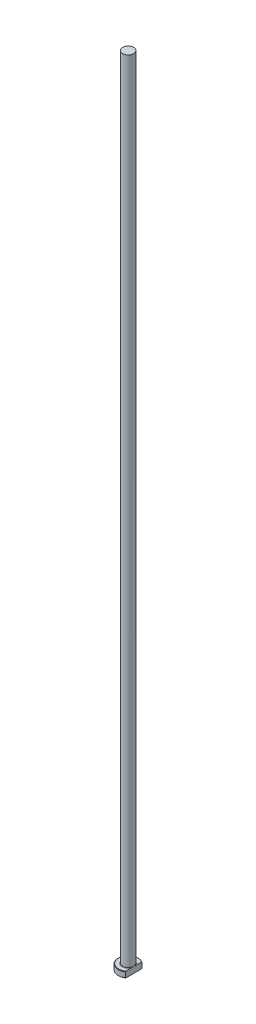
ISO-10303-21;
HEADER;
FILE_DESCRIPTION(('STEP AP214'),'2;1');
FILE_NAME('part.step','',(''),(''),'','','');
FILE_SCHEMA(('AUTOMOTIVE_DESIGN { 1 0 10303 214 1 1 1 1 }'));
ENDSEC;
DATA;
#1=APPLICATION_CONTEXT('core data for automotive mechanical design processes');
#2=APPLICATION_PROTOCOL_DEFINITION('international standard','automotive_design',2000,#1);
#3=PRODUCT_CONTEXT('',#1,'mechanical');
#4=PRODUCT('Part','Part','',(#3));
#5=PRODUCT_RELATED_PRODUCT_CATEGORY('part','',(#4));
#6=PRODUCT_DEFINITION_FORMATION('','',#4);
#7=PRODUCT_DEFINITION_CONTEXT('part definition',#1,'design');
#8=PRODUCT_DEFINITION('design','',#6,#7);
#9=PRODUCT_DEFINITION_SHAPE('','',#8);
#10=(LENGTH_UNIT() NAMED_UNIT(*) SI_UNIT(.MILLI.,.METRE.));
#11=(NAMED_UNIT(*) PLANE_ANGLE_UNIT() SI_UNIT($,.RADIAN.));
#12=(NAMED_UNIT(*) SI_UNIT($,.STERADIAN.) SOLID_ANGLE_UNIT());
#13=UNCERTAINTY_MEASURE_WITH_UNIT(LENGTH_MEASURE(1.E-05),#10,'distance_accuracy_value','');
#14=(GEOMETRIC_REPRESENTATION_CONTEXT(3) GLOBAL_UNCERTAINTY_ASSIGNED_CONTEXT((#13)) GLOBAL_UNIT_ASSIGNED_CONTEXT((#10,
#11,#12)) REPRESENTATION_CONTEXT('',''));
#15=CARTESIAN_POINT('',(0.,0.,0.));
#16=DIRECTION('',(0.,0.,1.));
#17=DIRECTION('',(1.,0.,0.));
#18=AXIS2_PLACEMENT_3D('',#15,#16,#17);
#19=CARTESIAN_POINT('',(0.,0.,0.));
#20=DIRECTION('',(0.,-1.,0.));
#21=DIRECTION('',(0.,0.,-1.));
#22=AXIS2_PLACEMENT_3D('',#19,#20,#21);
#23=PLANE('',#22);
#24=CARTESIAN_POINT('',(0.,0.,0.));
#25=DIRECTION('',(0.,-1.,0.));
#26=DIRECTION('',(0.,0.,-1.));
#27=AXIS2_PLACEMENT_3D('',#24,#25,#26);
#28=CIRCLE('',#27,4.79999999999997);
#29=CARTESIAN_POINT('',(2.74999999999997,0.,3.93414539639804));
#30=VERTEX_POINT('',#29);
#31=CARTESIAN_POINT('',(2.74999999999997,0.,-3.93414539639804));
#32=VERTEX_POINT('',#31);
#33=EDGE_CURVE('E98',#30,#32,#28,.T.);
#34=ORIENTED_EDGE('',*,*,#33,.T.);
#35=DIRECTION('',(0.,0.,1.));
#36=VECTOR('',#35,1.);
#37=CARTESIAN_POINT('',(2.74999999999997,0.,-4.1758232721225));
#38=LINE('',#37,#36);
#39=EDGE_CURVE('E83',#32,#30,#38,.T.);
#40=ORIENTED_EDGE('',*,*,#39,.T.);
#41=EDGE_LOOP('',(#34,#40));
#42=FACE_BOUND('',#41,.T.);
#43=ADVANCED_FACE('F32',(#42),#23,.T.);
#44=CARTESIAN_POINT('',(0.,259.958771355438,0.));
#45=DIRECTION('',(0.,1.,0.));
#46=DIRECTION('',(0.,0.,1.));
#47=AXIS2_PLACEMENT_3D('',#44,#45,#46);
#48=CYLINDRICAL_SURFACE('',#47,4.99999999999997);
#49=CARTESIAN_POINT('',(0.,2.80000000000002,0.));
#50=DIRECTION('',(0.,1.,0.));
#51=DIRECTION('',(0.,0.,1.));
#52=AXIS2_PLACEMENT_3D('',#49,#50,#51);
#53=CIRCLE('',#52,4.99999999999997);
#54=CARTESIAN_POINT('',(2.74999999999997,2.80000000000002,4.1758232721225));
#55=VERTEX_POINT('',#54);
#56=CARTESIAN_POINT('',(2.74999999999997,2.80000000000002,-4.1758232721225));
#57=VERTEX_POINT('',#56);
#58=EDGE_CURVE('E104',#55,#57,#53,.F.);
#59=ORIENTED_EDGE('',*,*,#58,.T.);
#60=DIRECTION('',(0.,-1.,0.));
#61=VECTOR('',#60,1.);
#62=CARTESIAN_POINT('',(2.74999999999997,400.,-4.1758232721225));
#63=LINE('',#62,#61);
#64=CARTESIAN_POINT('',(2.74999999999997,0.199999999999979,-4.1758232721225));
#65=VERTEX_POINT('',#64);
#66=EDGE_CURVE('E183',#57,#65,#63,.T.);
#67=ORIENTED_EDGE('',*,*,#66,.T.);
#68=CARTESIAN_POINT('',(0.,0.199999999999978,0.));
#69=DIRECTION('',(0.,-1.,0.));
#70=DIRECTION('',(0.,0.,-1.));
#71=AXIS2_PLACEMENT_3D('',#68,#69,#70);
#72=CIRCLE('',#71,4.99999999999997);
#73=CARTESIAN_POINT('',(2.74999999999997,0.199999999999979,4.1758232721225));
#74=VERTEX_POINT('',#73);
#75=EDGE_CURVE('E100',#65,#74,#72,.F.);
#76=ORIENTED_EDGE('',*,*,#75,.T.);
#77=DIRECTION('',(0.,-1.,0.));
#78=VECTOR('',#77,1.);
#79=CARTESIAN_POINT('',(2.74999999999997,400.,4.1758232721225));
#80=LINE('',#79,#78);
#81=EDGE_CURVE('E93',#55,#74,#80,.T.);
#82=ORIENTED_EDGE('',*,*,#81,.F.);
#83=EDGE_LOOP('',(#59,#67,#76,#82));
#84=FACE_BOUND('',#83,.T.);
#85=ADVANCED_FACE('F158',(#84),#48,.T.);
#86=CARTESIAN_POINT('',(-4.99999999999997,3.,0.));
#87=DIRECTION('',(0.,1.,0.));
#88=DIRECTION('',(0.,0.,1.));
#89=AXIS2_PLACEMENT_3D('',#86,#87,#88);
#90=PLANE('',#89);
#91=CARTESIAN_POINT('',(0.,3.,0.));
#92=DIRECTION('',(0.,1.,0.));
#93=DIRECTION('',(0.,0.,1.));
#94=AXIS2_PLACEMENT_3D('',#91,#92,#93);
#95=CIRCLE('',#94,4.79999999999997);
#96=CARTESIAN_POINT('',(2.74999999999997,3.,-3.93414539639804));
#97=VERTEX_POINT('',#96);
#98=CARTESIAN_POINT('',(2.74999999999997,3.,3.93414539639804));
#99=VERTEX_POINT('',#98);
#100=EDGE_CURVE('E178',#97,#99,#95,.T.);
#101=ORIENTED_EDGE('',*,*,#100,.T.);
#102=DIRECTION('',(0.,0.,-1.));
#103=VECTOR('',#102,1.);
#104=CARTESIAN_POINT('',(2.74999999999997,3.,0.));
#105=LINE('',#104,#103);
#106=CARTESIAN_POINT('',(2.74999999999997,2.99999999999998,1.06770782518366));
#107=VERTEX_POINT('',#106);
#108=EDGE_CURVE('E57',#99,#107,#105,.T.);
#109=ORIENTED_EDGE('',*,*,#108,.T.);
#110=CARTESIAN_POINT('',(0.,3.,0.));
#111=DIRECTION('',(0.,1.,0.));
#112=DIRECTION('',(0.,0.,1.));
#113=AXIS2_PLACEMENT_3D('',#110,#111,#112);
#114=CIRCLE('',#113,2.94999999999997);
#115=CARTESIAN_POINT('',(2.74999999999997,2.99999999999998,-1.06770782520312));
#116=VERTEX_POINT('',#115);
#117=EDGE_CURVE('E107',#107,#116,#114,.F.);
#118=ORIENTED_EDGE('',*,*,#117,.T.);
#119=EDGE_CURVE('E136',#116,#97,#105,.T.);
#120=ORIENTED_EDGE('',*,*,#119,.T.);
#121=EDGE_LOOP('',(#101,#109,#118,#120));
#122=FACE_BOUND('',#121,.T.);
#123=ADVANCED_FACE('F147',(#122),#90,.T.);
#124=CARTESIAN_POINT('',(0.,3.,0.));
#125=DIRECTION('',(0.,-1.,0.));
#126=DIRECTION('',(0.,0.,-1.));
#127=AXIS2_PLACEMENT_3D('',#124,#125,#126);
#128=CONICAL_SURFACE('',#127,4.79999999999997,0.785398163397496);
#129=ORIENTED_EDGE('',*,*,#58,.F.);
#130=CARTESIAN_POINT('',(2.74999999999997,-1.79114558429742,9.18844783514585));
#131=CARTESIAN_POINT('',(2.74999999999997,-1.62476324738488,9.0147689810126));
#132=CARTESIAN_POINT('',(2.74999999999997,-1.45857819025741,8.84090089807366));
#133=CARTESIAN_POINT('',(2.74999999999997,-1.12668775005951,8.49270511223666));
#134=CARTESIAN_POINT('',(2.74999999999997,-0.960982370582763,8.31837740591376));
#135=CARTESIAN_POINT('',(2.74999999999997,-0.464632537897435,7.79449769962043));
#136=CARTESIAN_POINT('',(2.74999999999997,-0.13483958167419,7.44413786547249));
#137=CARTESIAN_POINT('',(2.74999999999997,0.521406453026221,6.74030951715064));
#138=CARTESIAN_POINT('',(2.74999999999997,0.847859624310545,6.38684108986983));
#139=CARTESIAN_POINT('',(2.74999999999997,1.33353933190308,5.85303151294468));
#140=CARTESIAN_POINT('',(2.74999999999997,1.49475728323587,5.67450358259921));
#141=CARTESIAN_POINT('',(2.74999999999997,1.8154555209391,5.31589537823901));
#142=CARTESIAN_POINT('',(2.74999999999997,1.97493583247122,5.13581512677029));
#143=CARTESIAN_POINT('',(2.74999999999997,2.28246157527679,4.78409714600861));
#144=CARTESIAN_POINT('',(2.74999999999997,2.43063567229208,4.6125721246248));
#145=CARTESIAN_POINT('',(2.74999999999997,2.72427023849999,4.26717959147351));
#146=CARTESIAN_POINT('',(2.74999999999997,2.86973045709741,4.09331186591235));
#147=CARTESIAN_POINT('',(2.74999999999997,3.15716227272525,3.74214491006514));
#148=CARTESIAN_POINT('',(2.74999999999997,3.29912659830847,3.56483970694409));
#149=CARTESIAN_POINT('',(2.74999999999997,3.57763983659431,3.20603939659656));
#150=CARTESIAN_POINT('',(2.74999999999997,3.7141898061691,3.02454511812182));
#151=CARTESIAN_POINT('',(2.74999999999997,3.93857405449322,2.71219163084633));
#152=CARTESIAN_POINT('',(2.74999999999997,4.02851673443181,2.58285434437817));
#153=CARTESIAN_POINT('',(2.74999999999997,4.20308451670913,2.3205424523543));
#154=CARTESIAN_POINT('',(2.74999999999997,4.28770764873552,2.18756652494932));
#155=CARTESIAN_POINT('',(2.74999999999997,4.44931959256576,1.91735675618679));
#156=CARTESIAN_POINT('',(2.74999999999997,4.52632375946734,1.7801322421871));
#157=CARTESIAN_POINT('',(2.74999999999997,4.66966790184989,1.50031327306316));
#158=CARTESIAN_POINT('',(2.74999999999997,4.73601725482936,1.35772367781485));
#159=CARTESIAN_POINT('',(2.74999999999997,4.86065113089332,1.04856386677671));
#160=CARTESIAN_POINT('',(2.74999999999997,4.91700799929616,0.881171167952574));
#161=CARTESIAN_POINT('',(2.74999999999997,4.9810280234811,0.625229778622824));
#162=CARTESIAN_POINT('',(2.74999999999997,4.99893817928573,0.539229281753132));
#163=CARTESIAN_POINT('',(2.74999999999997,5.02707157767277,0.365959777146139));
#164=CARTESIAN_POINT('',(2.74999999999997,5.03729562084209,0.278690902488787));
#165=CARTESIAN_POINT('',(2.74999999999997,5.04949232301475,0.102763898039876));
#166=CARTESIAN_POINT('',(2.74999999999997,5.05138838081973,0.0141003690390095));
#167=CARTESIAN_POINT('',(2.74999999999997,5.04659669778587,-0.16299024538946));
#168=CARTESIAN_POINT('',(2.74999999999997,5.03990892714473,-0.25141732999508));
#169=CARTESIAN_POINT('',(2.74999999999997,5.01835539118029,-0.427430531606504));
#170=CARTESIAN_POINT('',(2.74999999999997,5.00347341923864,-0.51501463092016));
#171=CARTESIAN_POINT('',(2.74999999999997,4.96636720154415,-0.688602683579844));
#172=CARTESIAN_POINT('',(2.74999999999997,4.94414138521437,-0.774606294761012));
#173=CARTESIAN_POINT('',(2.74999999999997,4.88037969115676,-0.988315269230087));
#174=CARTESIAN_POINT('',(2.74999999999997,4.8347849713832,-1.11480587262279));
#175=CARTESIAN_POINT('',(2.74999999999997,4.73271903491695,-1.36329985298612));
#176=CARTESIAN_POINT('',(2.74999999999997,4.67623944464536,-1.48529968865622));
#177=CARTESIAN_POINT('',(2.74999999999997,4.55498227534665,-1.72582737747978));
#178=CARTESIAN_POINT('',(2.74999999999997,4.49016436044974,-1.84433466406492));
#179=CARTESIAN_POINT('',(2.74999999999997,4.38849038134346,-2.01944141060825));
#180=CARTESIAN_POINT('',(2.74999999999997,4.35386385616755,-2.07735876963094));
#181=CARTESIAN_POINT('',(2.74999999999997,4.28331846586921,-2.19239883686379));
#182=CARTESIAN_POINT('',(2.74999999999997,4.24739965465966,-2.24952157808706));
#183=CARTESIAN_POINT('',(2.74999999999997,4.12488368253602,-2.44019263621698));
#184=CARTESIAN_POINT('',(2.74999999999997,4.03574833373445,-2.57211125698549));
#185=CARTESIAN_POINT('',(2.74999999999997,3.85300432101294,-2.83282496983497));
#186=CARTESIAN_POINT('',(2.74999999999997,3.75939460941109,-2.96161931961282));
#187=CARTESIAN_POINT('',(2.74999999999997,3.56878484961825,-3.21681212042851));
#188=CARTESIAN_POINT('',(2.74999999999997,3.47178237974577,-3.34320875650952));
#189=CARTESIAN_POINT('',(2.74999999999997,3.27524323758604,-3.59402090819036));
#190=CARTESIAN_POINT('',(2.74999999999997,3.17570641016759,-3.71843630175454));
#191=CARTESIAN_POINT('',(2.74999999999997,2.97442282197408,-3.96596722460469));
#192=CARTESIAN_POINT('',(2.74999999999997,2.87267126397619,-4.08907884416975));
#193=CARTESIAN_POINT('',(2.74999999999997,2.66760125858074,-4.3339916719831));
#194=CARTESIAN_POINT('',(2.74999999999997,2.56428277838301,-4.45579285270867));
#195=CARTESIAN_POINT('',(2.74999999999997,2.25255029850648,-4.81947940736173));
#196=CARTESIAN_POINT('',(2.74999999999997,2.04226620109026,-5.05976099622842));
#197=CARTESIAN_POINT('',(2.74999999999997,1.61812846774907,-5.5376054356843));
#198=CARTESIAN_POINT('',(2.74999999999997,1.40427119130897,-5.77516503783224));
#199=CARTESIAN_POINT('',(2.74999999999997,0.974157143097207,-6.24814387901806));
#200=CARTESIAN_POINT('',(2.74999999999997,0.757900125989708,-6.48356289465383));
#201=CARTESIAN_POINT('',(2.74999999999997,0.323911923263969,-6.95249982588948));
#202=CARTESIAN_POINT('',(2.74999999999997,0.106182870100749,-7.186019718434));
#203=CARTESIAN_POINT('',(2.74999999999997,-0.330587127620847,-7.65182952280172));
#204=CARTESIAN_POINT('',(2.74999999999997,-0.549628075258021,-7.88411943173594));
#205=CARTESIAN_POINT('',(2.74999999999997,-0.854135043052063,-8.20563072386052));
#206=CARTESIAN_POINT('',(2.74999999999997,-0.939169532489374,-8.29526139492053));
#207=CARTESIAN_POINT('',(2.74999999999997,-1.10939110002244,-8.47440444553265));
#208=CARTESIAN_POINT('',(2.74999999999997,-1.19457819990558,-8.56391680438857));
#209=CARTESIAN_POINT('',(2.74999999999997,-1.36493542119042,-8.74266965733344));
#210=CARTESIAN_POINT('',(2.74999999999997,-1.45010532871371,-8.83191035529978));
#211=CARTESIAN_POINT('',(2.74999999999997,-1.62054776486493,-9.01026683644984));
#212=CARTESIAN_POINT('',(2.74999999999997,-1.70582027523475,-9.09938263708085));
#213=CARTESIAN_POINT('',(2.74999999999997,-1.79114558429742,-9.18844783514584));
#214=B_SPLINE_CURVE_WITH_KNOTS('',3,(#130,#131,#132,#133,#134,#135,#136,#137,#138,#139,#140,
#141,#142,#143,#144,#145,#146,#147,#148,#149,#150,#151,#152,#153,#154,#155,#156,#157,#158,#159,
#160,#161,#162,#163,#164,#165,#166,#167,#168,#169,#170,#171,#172,#173,#174,#175,#176,#177,#178,
#179,#180,#181,#182,#183,#184,#185,#186,#187,#188,#189,#190,#191,#192,#193,#194,#195,#196,#197,
#198,#199,#200,#201,#202,#203,#204,#205,#206,#207,#208,#209,#210,#211,#212,#213),.UNSPECIFIED.,
.F.,.F.,(4,2,2,2,2,2,2,2,2,2,2,2,2,2,2,2,2,2,2,2,2,2,2,2,2,2,2,2,2,2,2,2,2,2,2,2,2,2,2,2,2,4),
(0.,0.721544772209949,1.4430949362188,2.88656432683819,4.32999349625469,5.05163004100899,
5.77325612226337,6.45322671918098,7.13325979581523,7.81460476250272,8.49581607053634,
8.96833065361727,9.4410192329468,9.91273488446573,10.3840330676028,10.9119743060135,
11.1752192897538,11.4384368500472,11.7040704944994,11.9697050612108,12.2358669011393,
12.5020857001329,12.9047274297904,13.3076801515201,13.712661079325,13.9150857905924,
14.1175020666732,14.5949844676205,15.0725792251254,15.5505221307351,16.0284943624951,
16.5076321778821,16.9867800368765,17.94463622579,18.9035363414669,19.862535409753,
20.8203587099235,21.7781842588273,22.1488332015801,22.5195401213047,22.889621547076,
23.259644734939),.UNSPECIFIED.);
#215=EDGE_CURVE('E135',#55,#99,#214,.T.);
#216=ORIENTED_EDGE('',*,*,#215,.T.);
#217=ORIENTED_EDGE('',*,*,#100,.F.);
#218=EDGE_CURVE('E127',#97,#57,#214,.T.);
#219=ORIENTED_EDGE('',*,*,#218,.T.);
#220=EDGE_LOOP('',(#129,#216,#217,#219));
#221=FACE_BOUND('',#220,.T.);
#222=ADVANCED_FACE('F143',(#221),#128,.T.);
#223=CARTESIAN_POINT('',(0.,0.199999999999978,0.));
#224=DIRECTION('',(0.,1.,0.));
#225=DIRECTION('',(0.,0.,1.));
#226=AXIS2_PLACEMENT_3D('',#223,#224,#225);
#227=CONICAL_SURFACE('',#226,4.99999999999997,0.785398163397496);
#228=ORIENTED_EDGE('',*,*,#75,.F.);
#229=CARTESIAN_POINT('',(2.74999999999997,4.79114558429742,-9.18844783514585));
#230=CARTESIAN_POINT('',(2.74999999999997,4.62476324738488,-9.0147689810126));
#231=CARTESIAN_POINT('',(2.74999999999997,4.45857819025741,-8.84090089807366));
#232=CARTESIAN_POINT('',(2.74999999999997,4.12668775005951,-8.49270511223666));
#233=CARTESIAN_POINT('',(2.74999999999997,3.96098237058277,-8.31837740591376));
#234=CARTESIAN_POINT('',(2.74999999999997,3.46463253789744,-7.79449769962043));
#235=CARTESIAN_POINT('',(2.74999999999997,3.13483958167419,-7.44413786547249));
#236=CARTESIAN_POINT('',(2.74999999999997,2.47859354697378,-6.74030951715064));
#237=CARTESIAN_POINT('',(2.74999999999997,2.15214037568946,-6.38684108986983));
#238=CARTESIAN_POINT('',(2.74999999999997,1.66646066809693,-5.85303151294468));
#239=CARTESIAN_POINT('',(2.74999999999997,1.50524271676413,-5.67450358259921));
#240=CARTESIAN_POINT('',(2.74999999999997,1.1845444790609,-5.31589537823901));
#241=CARTESIAN_POINT('',(2.74999999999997,1.02506416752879,-5.13581512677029));
#242=CARTESIAN_POINT('',(2.74999999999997,0.717538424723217,-4.78409714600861));
#243=CARTESIAN_POINT('',(2.74999999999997,0.569364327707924,-4.6125721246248));
#244=CARTESIAN_POINT('',(2.74999999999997,0.275729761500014,-4.26717959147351));
#245=CARTESIAN_POINT('',(2.74999999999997,0.130269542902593,-4.09331186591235));
#246=CARTESIAN_POINT('',(2.74999999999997,-0.157162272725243,-3.74214491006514));
#247=CARTESIAN_POINT('',(2.74999999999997,-0.299126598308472,-3.56483970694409));
#248=CARTESIAN_POINT('',(2.74999999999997,-0.577639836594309,-3.20603939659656));
#249=CARTESIAN_POINT('',(2.74999999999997,-0.714189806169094,-3.02454511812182));
#250=CARTESIAN_POINT('',(2.74999999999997,-0.938574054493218,-2.71219163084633));
#251=CARTESIAN_POINT('',(2.74999999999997,-1.02851673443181,-2.58285434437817));
#252=CARTESIAN_POINT('',(2.74999999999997,-1.20308451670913,-2.3205424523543));
#253=CARTESIAN_POINT('',(2.74999999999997,-1.28770764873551,-2.18756652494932));
#254=CARTESIAN_POINT('',(2.74999999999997,-1.44931959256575,-1.91735675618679));
#255=CARTESIAN_POINT('',(2.74999999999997,-1.52632375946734,-1.7801322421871));
#256=CARTESIAN_POINT('',(2.74999999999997,-1.66966790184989,-1.50031327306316));
#257=CARTESIAN_POINT('',(2.74999999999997,-1.73601725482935,-1.35772367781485));
#258=CARTESIAN_POINT('',(2.74999999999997,-1.86065113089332,-1.04856386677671));
#259=CARTESIAN_POINT('',(2.74999999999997,-1.91700799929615,-0.881171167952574));
#260=CARTESIAN_POINT('',(2.74999999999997,-1.9810280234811,-0.625229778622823));
#261=CARTESIAN_POINT('',(2.74999999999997,-1.99893817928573,-0.539229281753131));
#262=CARTESIAN_POINT('',(2.74999999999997,-2.02707157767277,-0.365959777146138));
#263=CARTESIAN_POINT('',(2.74999999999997,-2.03729562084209,-0.278690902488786));
#264=CARTESIAN_POINT('',(2.74999999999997,-2.04949232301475,-0.102763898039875));
#265=CARTESIAN_POINT('',(2.74999999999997,-2.05138838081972,-0.0141003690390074));
#266=CARTESIAN_POINT('',(2.74999999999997,-2.04659669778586,0.162990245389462));
#267=CARTESIAN_POINT('',(2.74999999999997,-2.03990892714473,0.251417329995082));
#268=CARTESIAN_POINT('',(2.74999999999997,-2.01835539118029,0.427430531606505));
#269=CARTESIAN_POINT('',(2.74999999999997,-2.00347341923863,0.515014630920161));
#270=CARTESIAN_POINT('',(2.74999999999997,-1.96636720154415,0.688602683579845));
#271=CARTESIAN_POINT('',(2.74999999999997,-1.94414138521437,0.774606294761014));
#272=CARTESIAN_POINT('',(2.74999999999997,-1.88037969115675,0.988315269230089));
#273=CARTESIAN_POINT('',(2.74999999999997,-1.83478497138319,1.1148058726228));
#274=CARTESIAN_POINT('',(2.74999999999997,-1.73271903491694,1.36329985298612));
#275=CARTESIAN_POINT('',(2.74999999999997,-1.67623944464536,1.48529968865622));
#276=CARTESIAN_POINT('',(2.74999999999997,-1.55498227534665,1.72582737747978));
#277=CARTESIAN_POINT('',(2.74999999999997,-1.49016436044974,1.84433466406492));
#278=CARTESIAN_POINT('',(2.74999999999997,-1.38849038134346,2.01944141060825));
#279=CARTESIAN_POINT('',(2.74999999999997,-1.35386385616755,2.07735876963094));
#280=CARTESIAN_POINT('',(2.74999999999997,-1.2833184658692,2.19239883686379));
#281=CARTESIAN_POINT('',(2.74999999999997,-1.24739965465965,2.24952157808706));
#282=CARTESIAN_POINT('',(2.74999999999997,-1.12488368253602,2.44019263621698));
#283=CARTESIAN_POINT('',(2.74999999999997,-1.03574833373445,2.57211125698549));
#284=CARTESIAN_POINT('',(2.74999999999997,-0.853004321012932,2.83282496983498));
#285=CARTESIAN_POINT('',(2.74999999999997,-0.759394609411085,2.96161931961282));
#286=CARTESIAN_POINT('',(2.74999999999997,-0.568784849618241,3.21681212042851));
#287=CARTESIAN_POINT('',(2.74999999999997,-0.471782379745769,3.34320875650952));
#288=CARTESIAN_POINT('',(2.74999999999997,-0.275243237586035,3.59402090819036));
#289=CARTESIAN_POINT('',(2.74999999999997,-0.175706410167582,3.71843630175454));
#290=CARTESIAN_POINT('',(2.74999999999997,0.0255771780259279,3.96596722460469));
#291=CARTESIAN_POINT('',(2.74999999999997,0.127328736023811,4.08907884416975));
#292=CARTESIAN_POINT('',(2.74999999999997,0.33239874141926,4.3339916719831));
#293=CARTESIAN_POINT('',(2.74999999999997,0.435717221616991,4.45579285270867));
#294=CARTESIAN_POINT('',(2.74999999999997,0.747449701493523,4.81947940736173));
#295=CARTESIAN_POINT('',(2.74999999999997,0.957733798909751,5.05976099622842));
#296=CARTESIAN_POINT('',(2.74999999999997,1.38187153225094,5.53760543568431));
#297=CARTESIAN_POINT('',(2.74999999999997,1.59572880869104,5.77516503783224));
#298=CARTESIAN_POINT('',(2.74999999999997,2.0258428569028,6.24814387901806));
#299=CARTESIAN_POINT('',(2.74999999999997,2.2420998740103,6.48356289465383));
#300=CARTESIAN_POINT('',(2.74999999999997,2.67608807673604,6.95249982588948));
#301=CARTESIAN_POINT('',(2.74999999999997,2.89381712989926,7.186019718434));
#302=CARTESIAN_POINT('',(2.74999999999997,3.33058712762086,7.65182952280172));
#303=CARTESIAN_POINT('',(2.74999999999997,3.54962807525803,7.88411943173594));
#304=CARTESIAN_POINT('',(2.74999999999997,3.85413504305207,8.20563072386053));
#305=CARTESIAN_POINT('',(2.74999999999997,3.93916953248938,8.29526139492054));
#306=CARTESIAN_POINT('',(2.74999999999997,4.10939110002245,8.47440444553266));
#307=CARTESIAN_POINT('',(2.74999999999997,4.19457819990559,8.56391680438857));
#308=CARTESIAN_POINT('',(2.74999999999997,4.36493542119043,8.74266965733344));
#309=CARTESIAN_POINT('',(2.74999999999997,4.45010532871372,8.83191035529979));
#310=CARTESIAN_POINT('',(2.74999999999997,4.62054776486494,9.01026683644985));
#311=CARTESIAN_POINT('',(2.74999999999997,4.70582027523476,9.09938263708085));
#312=CARTESIAN_POINT('',(2.74999999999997,4.79114558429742,9.18844783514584));
#313=B_SPLINE_CURVE_WITH_KNOTS('',3,(#229,#230,#231,#232,#233,#234,#235,#236,#237,#238,#239,
#240,#241,#242,#243,#244,#245,#246,#247,#248,#249,#250,#251,#252,#253,#254,#255,#256,#257,#258,
#259,#260,#261,#262,#263,#264,#265,#266,#267,#268,#269,#270,#271,#272,#273,#274,#275,#276,#277,
#278,#279,#280,#281,#282,#283,#284,#285,#286,#287,#288,#289,#290,#291,#292,#293,#294,#295,#296,
#297,#298,#299,#300,#301,#302,#303,#304,#305,#306,#307,#308,#309,#310,#311,#312),.UNSPECIFIED.,
.F.,.F.,(4,2,2,2,2,2,2,2,2,2,2,2,2,2,2,2,2,2,2,2,2,2,2,2,2,2,2,2,2,2,2,2,2,2,2,2,2,2,2,2,2,4),
(0.,0.721544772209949,1.4430949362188,2.88656432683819,4.32999349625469,5.05163004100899,
5.77325612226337,6.45322671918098,7.13325979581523,7.81460476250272,8.49581607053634,
8.96833065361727,9.4410192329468,9.91273488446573,10.3840330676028,10.9119743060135,
11.1752192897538,11.4384368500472,11.7040704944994,11.9697050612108,12.2358669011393,
12.5020857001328,12.9047274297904,13.3076801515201,13.712661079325,13.9150857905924,
14.1175020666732,14.5949844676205,15.0725792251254,15.5505221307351,16.0284943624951,
16.5076321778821,16.9867800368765,17.94463622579,18.9035363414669,19.862535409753,
20.8203587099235,21.7781842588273,22.1488332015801,22.5195401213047,22.889621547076,
23.259644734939),.UNSPECIFIED.);
#314=EDGE_CURVE('E86',#65,#32,#313,.T.);
#315=ORIENTED_EDGE('',*,*,#314,.T.);
#316=ORIENTED_EDGE('',*,*,#33,.F.);
#317=EDGE_CURVE('E89',#30,#74,#313,.T.);
#318=ORIENTED_EDGE('',*,*,#317,.T.);
#319=EDGE_LOOP('',(#228,#315,#316,#318));
#320=FACE_BOUND('',#319,.T.);
#321=ADVANCED_FACE('F97',(#320),#227,.T.);
#322=CARTESIAN_POINT('',(0.,3.19999999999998,0.));
#323=DIRECTION('',(0.,1.,0.));
#324=DIRECTION('',(0.,0.,1.));
#325=AXIS2_PLACEMENT_3D('',#322,#323,#324);
#326=TOROIDAL_SURFACE('',#325,2.94999999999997,0.2);
#327=CARTESIAN_POINT('',(2.74999999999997,3.19999999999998,0.));
#328=CARTESIAN_POINT('',(2.74999999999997,3.20000050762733,1.12997179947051E-10));
#329=CARTESIAN_POINT('',(2.74999999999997,3.20000101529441,-1.81527532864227E-07));
#330=CARTESIAN_POINT('',(2.74999999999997,3.20000196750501,-6.94840309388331E-07));
#331=CARTESIAN_POINT('',(2.74999999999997,3.20000240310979,-1.03787717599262E-06));
#332=CARTESIAN_POINT('',(2.74999999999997,3.20000330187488,-1.85808127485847E-06));
#333=CARTESIAN_POINT('',(2.74999999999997,3.20000375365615,-2.34835981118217E-06));
#334=CARTESIAN_POINT('',(2.74999999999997,3.20000456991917,-3.3704695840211E-06));
#335=CARTESIAN_POINT('',(2.74999999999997,3.20000493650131,-3.90074158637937E-06));
#336=CARTESIAN_POINT('',(2.74999999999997,3.20000627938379,-5.9326172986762E-06));
#337=CARTESIAN_POINT('',(2.74999999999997,3.20000718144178,-7.48563172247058E-06));
#338=CARTESIAN_POINT('',(2.74999999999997,3.20000868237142,-1.0579008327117E-05));
#339=CARTESIAN_POINT('',(2.74999999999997,3.20000929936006,-1.21109700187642E-05));
#340=CARTESIAN_POINT('',(2.74999999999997,3.2000118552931,-1.85322192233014E-05));
#341=CARTESIAN_POINT('',(2.74999999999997,3.20001373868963,-2.34472711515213E-05));
#342=CARTESIAN_POINT('',(2.74999999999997,3.20001654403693,-3.27779451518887E-05));
#343=CARTESIAN_POINT('',(2.74999999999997,3.20001756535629,-3.71636222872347E-05));
#344=CARTESIAN_POINT('',(2.74999999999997,3.20002495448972,-6.95743732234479E-05));
#345=CARTESIAN_POINT('',(2.74999999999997,3.20003050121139,-9.77394523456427E-05));
#346=CARTESIAN_POINT('',(2.74999999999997,3.20005478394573,-0.000208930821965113));
#347=CARTESIAN_POINT('',(2.74999999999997,3.2000780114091,-0.000290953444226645));
#348=CARTESIAN_POINT('',(2.74999999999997,3.20016837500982,-0.000615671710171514));
#349=CARTESIAN_POINT('',(2.74999999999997,3.20023256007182,-0.0008589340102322));
#350=CARTESIAN_POINT('',(2.74999999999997,3.20048946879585,-0.00182516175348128));
#351=CARTESIAN_POINT('',(2.74999999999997,3.20068588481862,-0.00254739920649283));
#352=CARTESIAN_POINT('',(2.74999999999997,3.20150145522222,-0.0055546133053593));
#353=CARTESIAN_POINT('',(2.74999999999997,3.20211597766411,-0.00784050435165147));
#354=CARTESIAN_POINT('',(2.74999999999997,3.20754641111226,-0.0280301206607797));
#355=CARTESIAN_POINT('',(2.74999999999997,3.2123805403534,-0.0459303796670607));
#356=CARTESIAN_POINT('',(2.74999999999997,3.22182435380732,-0.081029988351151));
#357=CARTESIAN_POINT('',(2.74999999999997,3.226435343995,-0.0982290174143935));
#358=CARTESIAN_POINT('',(2.74999999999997,3.23620184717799,-0.134808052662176));
#359=CARTESIAN_POINT('',(2.74999999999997,3.24135263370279,-0.154189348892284));
#360=CARTESIAN_POINT('',(2.74999999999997,3.25163624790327,-0.193181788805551));
#361=CARTESIAN_POINT('',(2.74999999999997,3.25676827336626,-0.21279314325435));
#362=CARTESIAN_POINT('',(2.74999999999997,3.26905119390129,-0.260223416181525));
#363=CARTESIAN_POINT('',(2.74999999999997,3.27615177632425,-0.288055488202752));
#364=CARTESIAN_POINT('',(2.74999999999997,3.28988618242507,-0.343037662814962));
#365=CARTESIAN_POINT('',(2.74999999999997,3.29652742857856,-0.370185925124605));
#366=CARTESIAN_POINT('',(2.74999999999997,3.3179119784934,-0.460013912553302));
#367=CARTESIAN_POINT('',(2.74999999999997,3.33192996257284,-0.522872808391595));
#368=CARTESIAN_POINT('',(2.74999999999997,3.35724782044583,-0.649858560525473));
#369=CARTESIAN_POINT('',(2.74999999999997,3.36851625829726,-0.713991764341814));
#370=CARTESIAN_POINT('',(2.74999999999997,3.38744836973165,-0.848144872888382));
#371=CARTESIAN_POINT('',(2.74999999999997,3.39474814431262,-0.918222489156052));
#372=CARTESIAN_POINT('',(2.74999999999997,3.39971832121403,-1.02344881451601));
#373=CARTESIAN_POINT('',(2.74999999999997,3.40038441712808,-1.05845158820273));
#374=CARTESIAN_POINT('',(2.74999999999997,3.39917295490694,-1.12840448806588));
#375=CARTESIAN_POINT('',(2.74999999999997,3.39729798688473,-1.16335463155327));
#376=CARTESIAN_POINT('',(2.74999999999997,3.39199994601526,-1.21505383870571));
#377=CARTESIAN_POINT('',(2.74999999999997,3.38986571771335,-1.23193598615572));
#378=CARTESIAN_POINT('',(2.74999999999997,3.38464996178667,-1.26557152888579));
#379=CARTESIAN_POINT('',(2.74999999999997,3.38156766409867,-1.28232480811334));
#380=CARTESIAN_POINT('',(2.74999999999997,3.37431364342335,-1.31540767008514));
#381=CARTESIAN_POINT('',(2.74999999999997,3.37015411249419,-1.33173987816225));
#382=CARTESIAN_POINT('',(2.74999999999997,3.36048976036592,-1.36399299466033));
#383=CARTESIAN_POINT('',(2.74999999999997,3.35498646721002,-1.37991434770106));
#384=CARTESIAN_POINT('',(2.74999999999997,3.34222746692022,-1.41123903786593));
#385=CARTESIAN_POINT('',(2.74999999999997,3.33495457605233,-1.42663549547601));
#386=CARTESIAN_POINT('',(2.74999999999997,3.318175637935,-1.45617471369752));
#387=CARTESIAN_POINT('',(2.74999999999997,3.30867792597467,-1.4703218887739));
#388=CARTESIAN_POINT('',(2.74999999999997,3.29277007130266,-1.48907990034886));
#389=CARTESIAN_POINT('',(2.74999999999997,3.2875192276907,-1.49466894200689));
#390=CARTESIAN_POINT('',(2.74999999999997,3.27634440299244,-1.50515028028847));
#391=CARTESIAN_POINT('',(2.74999999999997,3.27042002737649,-1.51004216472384));
#392=CARTESIAN_POINT('',(2.74999999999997,3.25778482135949,-1.51891099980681));
#393=CARTESIAN_POINT('',(2.74999999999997,3.2510643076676,-1.52287446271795));
#394=CARTESIAN_POINT('',(2.74999999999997,3.23698143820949,-1.5294174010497));
#395=CARTESIAN_POINT('',(2.74999999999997,3.22962116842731,-1.53200119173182));
#396=CARTESIAN_POINT('',(2.74999999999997,3.2166326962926,-1.53496289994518));
#397=CARTESIAN_POINT('',(2.74999999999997,3.2110985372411,-1.53575651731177));
#398=CARTESIAN_POINT('',(2.74999999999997,3.19997558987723,-1.53638738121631));
#399=CARTESIAN_POINT('',(2.74999999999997,3.19438682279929,-1.53622498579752));
#400=CARTESIAN_POINT('',(2.74999999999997,3.18332943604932,-1.53495937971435));
#401=CARTESIAN_POINT('',(2.74999999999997,3.17786061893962,-1.53385785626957));
#402=CARTESIAN_POINT('',(2.74999999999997,3.16716525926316,-1.53080991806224));
#403=CARTESIAN_POINT('',(2.74999999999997,3.16193889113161,-1.52886290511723));
#404=CARTESIAN_POINT('',(2.74999999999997,3.14983366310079,-1.52335528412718));
#405=CARTESIAN_POINT('',(2.74999999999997,3.14310699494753,-1.51946144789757));
#406=CARTESIAN_POINT('',(2.74999999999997,3.13035821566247,-1.51065443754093));
#407=CARTESIAN_POINT('',(2.74999999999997,3.12433789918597,-1.50573875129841));
#408=CARTESIAN_POINT('',(2.74999999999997,3.10956608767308,-1.4920109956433));
#409=CARTESIAN_POINT('',(2.74999999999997,3.10134587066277,-1.48263193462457));
#410=CARTESIAN_POINT('',(2.74999999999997,3.08638427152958,-1.46278796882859));
#411=CARTESIAN_POINT('',(2.74999999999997,3.07964511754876,-1.45232146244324));
#412=CARTESIAN_POINT('',(2.74999999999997,3.06171675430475,-1.42080727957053));
#413=CARTESIAN_POINT('',(2.74999999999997,3.05211924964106,-1.39886385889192));
#414=CARTESIAN_POINT('',(2.74999999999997,3.03592584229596,-1.35377597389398));
#415=CARTESIAN_POINT('',(2.74999999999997,3.02935693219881,-1.33062268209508));
#416=CARTESIAN_POINT('',(2.74999999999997,3.01641276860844,-1.27469229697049));
#417=CARTESIAN_POINT('',(2.74999999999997,3.01110503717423,-1.24167224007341));
#418=CARTESIAN_POINT('',(2.74999999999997,3.00364182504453,-1.17522319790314));
#419=CARTESIAN_POINT('',(2.74999999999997,3.00149608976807,-1.14179326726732));
#420=CARTESIAN_POINT('',(2.74999999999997,2.99965905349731,-1.0761846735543));
#421=CARTESIAN_POINT('',(2.74999999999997,2.9998750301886,-1.04400821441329));
#422=CARTESIAN_POINT('',(2.74999999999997,3.00208041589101,-0.979705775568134));
#423=CARTESIAN_POINT('',(2.74999999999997,3.00407086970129,-0.94757983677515));
#424=CARTESIAN_POINT('',(2.74999999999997,3.01231998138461,-0.849711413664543));
#425=CARTESIAN_POINT('',(2.74999999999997,3.02086596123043,-0.784164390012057));
#426=CARTESIAN_POINT('',(2.74999999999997,3.04217753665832,-0.652153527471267));
#427=CARTESIAN_POINT('',(2.74999999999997,3.05504187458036,-0.585706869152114));
#428=CARTESIAN_POINT('',(2.74999999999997,3.07899589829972,-0.474257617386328));
#429=CARTESIAN_POINT('',(2.74999999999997,3.08936705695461,-0.429096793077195));
#430=CARTESIAN_POINT('',(2.74999999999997,3.11088695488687,-0.339494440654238));
#431=CARTESIAN_POINT('',(2.74999999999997,3.12202574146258,-0.295050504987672));
#432=CARTESIAN_POINT('',(2.74999999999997,3.14355229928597,-0.211341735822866));
#433=CARTESIAN_POINT('',(2.74999999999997,3.15388178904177,-0.17206169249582));
#434=CARTESIAN_POINT('',(2.74999999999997,3.17523671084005,-0.0918970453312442));
#435=CARTESIAN_POINT('',(2.74999999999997,3.18627305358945,-0.0510152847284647));
#436=CARTESIAN_POINT('',(2.74999999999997,3.19788514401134,-0.00783595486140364));
#437=CARTESIAN_POINT('',(2.74999999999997,3.19850096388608,-0.00554554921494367));
#438=CARTESIAN_POINT('',(2.74999999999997,3.19931683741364,-0.00253730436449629));
#439=CARTESIAN_POINT('',(2.74999999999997,3.19951229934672,-0.00181855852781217));
#440=CARTESIAN_POINT('',(2.74999999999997,3.19976804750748,-0.000856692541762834));
#441=CARTESIAN_POINT('',(2.74999999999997,3.19983200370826,-0.000614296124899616));
#442=CARTESIAN_POINT('',(2.74999999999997,3.19992209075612,-0.000290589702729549));
#443=CARTESIAN_POINT('',(2.74999999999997,3.19994527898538,-0.000208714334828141));
#444=CARTESIAN_POINT('',(2.74999999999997,3.19996952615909,-9.76928428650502E-05));
#445=CARTESIAN_POINT('',(2.74999999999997,3.19997506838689,-6.95486157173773E-05));
#446=CARTESIAN_POINT('',(2.74999999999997,3.19998244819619,-3.71590915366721E-05));
#447=CARTESIAN_POINT('',(2.74999999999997,3.1999834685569,-3.2774592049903E-05));
#448=CARTESIAN_POINT('',(2.74999999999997,3.19998627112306,-2.34463157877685E-05));
#449=CARTESIAN_POINT('',(2.74999999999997,3.19998815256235,-1.85324214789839E-05));
#450=CARTESIAN_POINT('',(2.74999999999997,3.19999070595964,-1.21123670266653E-05));
#451=CARTESIAN_POINT('',(2.74999999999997,3.19999132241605,-1.05804935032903E-05));
#452=CARTESIAN_POINT('',(2.74999999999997,3.1999928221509,-7.4872040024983E-06));
#453=CARTESIAN_POINT('',(2.74999999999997,3.19999372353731,-5.93417784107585E-06));
#454=CARTESIAN_POINT('',(2.74999999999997,3.19999506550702,-3.90218205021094E-06));
#455=CARTESIAN_POINT('',(2.74999999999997,3.19999543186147,-3.37184999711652E-06));
#456=CARTESIAN_POINT('',(2.74999999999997,3.19999624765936,-2.3495790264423E-06));
#457=CARTESIAN_POINT('',(2.74999999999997,3.1999966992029,-1.85919798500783E-06));
#458=CARTESIAN_POINT('',(2.74999999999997,3.19999759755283,-1.03875218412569E-06));
#459=CARTESIAN_POINT('',(2.74999999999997,3.19999803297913,-6.95584891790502E-07));
#460=CARTESIAN_POINT('',(2.74999999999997,3.19999898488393,-1.81944076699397E-07));
#461=CARTESIAN_POINT('',(2.74999999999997,3.1999994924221,-1.12986168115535E-10));
#462=CARTESIAN_POINT('',(2.74999999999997,3.19999999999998,0.));
#463=B_SPLINE_CURVE_WITH_KNOTS('',3,(#327,#328,#329,#330,#331,#332,#333,#334,#335,#336,#337,
#338,#339,#340,#341,#342,#343,#344,#345,#346,#347,#348,#349,#350,#351,#352,#353,#354,#355,#356,
#357,#358,#359,#360,#361,#362,#363,#364,#365,#366,#367,#368,#369,#370,#371,#372,#373,#374,#375,
#376,#377,#378,#379,#380,#381,#382,#383,#384,#385,#386,#387,#388,#389,#390,#391,#392,#393,#394,
#395,#396,#397,#398,#399,#400,#401,#402,#403,#404,#405,#406,#407,#408,#409,#410,#411,#412,#413,
#414,#415,#416,#417,#418,#419,#420,#421,#422,#423,#424,#425,#426,#427,#428,#429,#430,#431,#432,
#433,#434,#435,#436,#437,#438,#439,#440,#441,#442,#443,#444,#445,#446,#447,#448,#449,#450,#451,
#452,#453,#454,#455,#456,#457,#458,#459,#460,#461,#462),.UNSPECIFIED.,.T.,.F.,(4,2,2,2,2,2,2,2,
2,2,2,2,2,2,2,2,2,2,2,2,2,2,2,2,2,2,2,2,2,2,2,2,2,2,2,2,2,2,2,2,2,2,2,2,2,2,2,2,2,2,2,2,2,2,2,2,
2,2,2,2,2,2,2,2,2,2,2,4),(0.,1.53302763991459E-06,3.19538931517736E-06,5.18410400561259E-06,
7.11680710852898E-06,1.24843266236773E-05,1.74346122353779E-05,3.3195428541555E-05,
4.66876455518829E-05,0.000132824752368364,0.000388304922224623,0.00114333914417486,
0.0033884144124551,0.0104899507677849,0.0661127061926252,0.119532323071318,0.179694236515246,
0.240509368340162,0.326678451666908,0.410524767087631,0.603684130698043,0.798958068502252,
1.00997653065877,1.11494231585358,1.21980118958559,1.27083021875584,1.32190080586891,
1.37241688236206,1.42287578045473,1.4738457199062,1.52462767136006,1.54758745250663,
1.57056075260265,1.59384955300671,1.61706507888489,1.6337610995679,1.65045086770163,
1.66711071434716,1.68378236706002,1.70696786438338,1.73021104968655,1.76741395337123,
1.80467244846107,1.87612299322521,1.94819858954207,2.0482867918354,2.14868283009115,
2.24515187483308,2.34167775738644,2.53976637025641,2.74273377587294,2.88173187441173,
3.01918106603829,3.14102752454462,3.268058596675,3.27517420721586,3.27740842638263,
3.27816077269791,3.27841579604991,3.27850186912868,3.27851535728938,3.27853111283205,
3.27853606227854,3.27854142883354,3.27854336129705,3.27854534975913,3.27854701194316,
3.2785485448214),.UNSPECIFIED.);
#464=CARTESIAN_POINT('',(2.74999999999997,3.19999999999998,0.));
#465=VERTEX_POINT('',#464);
#466=EDGE_CURVE('E11',#116,#465,#463,.T.);
#467=ORIENTED_EDGE('',*,*,#466,.F.);
#468=ORIENTED_EDGE('',*,*,#117,.F.);
#469=CARTESIAN_POINT('',(2.74999999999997,3.19999999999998,0.));
#470=CARTESIAN_POINT('',(2.74999999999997,3.19999949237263,-1.12997235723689E-10));
#471=CARTESIAN_POINT('',(2.74999999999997,3.19999898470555,1.8152753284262E-07));
#472=CARTESIAN_POINT('',(2.74999999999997,3.19999803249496,6.94840309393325E-07));
#473=CARTESIAN_POINT('',(2.74999999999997,3.19999759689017,1.03787717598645E-06));
#474=CARTESIAN_POINT('',(2.74999999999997,3.19999669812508,1.85808127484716E-06));
#475=CARTESIAN_POINT('',(2.74999999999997,3.19999624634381,2.34835981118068E-06));
#476=CARTESIAN_POINT('',(2.74999999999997,3.19999543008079,3.37046958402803E-06));
#477=CARTESIAN_POINT('',(2.74999999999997,3.19999506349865,3.90074158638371E-06));
#478=CARTESIAN_POINT('',(2.74999999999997,3.19999372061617,5.93261729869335E-06));
#479=CARTESIAN_POINT('',(2.74999999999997,3.19999281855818,7.48563172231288E-06));
#480=CARTESIAN_POINT('',(2.74999999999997,3.19999131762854,1.05790083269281E-05));
#481=CARTESIAN_POINT('',(2.74999999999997,3.1999907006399,1.21109700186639E-05));
#482=CARTESIAN_POINT('',(2.74999999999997,3.19998814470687,1.85322192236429E-05));
#483=CARTESIAN_POINT('',(2.74999999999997,3.19998626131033,2.34472711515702E-05));
#484=CARTESIAN_POINT('',(2.74999999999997,3.19998345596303,3.27779451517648E-05));
#485=CARTESIAN_POINT('',(2.74999999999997,3.19998243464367,3.71636222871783E-05));
#486=CARTESIAN_POINT('',(2.74999999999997,3.19997504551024,6.95743732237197E-05));
#487=CARTESIAN_POINT('',(2.74999999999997,3.19996949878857,9.77394523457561E-05));
#488=CARTESIAN_POINT('',(2.74999999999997,3.19994521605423,0.000208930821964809));
#489=CARTESIAN_POINT('',(2.74999999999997,3.19992198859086,0.000290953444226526));
#490=CARTESIAN_POINT('',(2.74999999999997,3.19983162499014,0.000615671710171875));
#491=CARTESIAN_POINT('',(2.74999999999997,3.19976743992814,0.000858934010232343));
#492=CARTESIAN_POINT('',(2.74999999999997,3.19951053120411,0.00182516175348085));
#493=CARTESIAN_POINT('',(2.74999999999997,3.19931411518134,0.00254739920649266));
#494=CARTESIAN_POINT('',(2.74999999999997,3.19849854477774,0.00555461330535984));
#495=CARTESIAN_POINT('',(2.74999999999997,3.19788402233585,0.00784050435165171));
#496=CARTESIAN_POINT('',(2.74999999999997,3.1924535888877,0.0280301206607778));
#497=CARTESIAN_POINT('',(2.74999999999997,3.18761945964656,0.0459303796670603));
#498=CARTESIAN_POINT('',(2.74999999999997,3.17817564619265,0.0810299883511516));
#499=CARTESIAN_POINT('',(2.74999999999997,3.17356465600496,0.0982290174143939));
#500=CARTESIAN_POINT('',(2.74999999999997,3.16379815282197,0.134808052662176));
#501=CARTESIAN_POINT('',(2.74999999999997,3.15864736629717,0.154189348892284));
#502=CARTESIAN_POINT('',(2.74999999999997,3.14836375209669,0.193181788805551));
#503=CARTESIAN_POINT('',(2.74999999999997,3.1432317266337,0.21279314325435));
#504=CARTESIAN_POINT('',(2.74999999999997,3.13094880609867,0.260223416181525));
#505=CARTESIAN_POINT('',(2.74999999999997,3.12384822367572,0.288055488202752));
#506=CARTESIAN_POINT('',(2.74999999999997,3.1101138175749,0.343037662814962));
#507=CARTESIAN_POINT('',(2.74999999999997,3.1034725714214,0.370185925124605));
#508=CARTESIAN_POINT('',(2.74999999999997,3.08208802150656,0.460013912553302));
#509=CARTESIAN_POINT('',(2.74999999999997,3.06807003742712,0.522872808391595));
#510=CARTESIAN_POINT('',(2.74999999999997,3.04275217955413,0.649858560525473));
#511=CARTESIAN_POINT('',(2.74999999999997,3.03148374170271,0.713991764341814));
#512=CARTESIAN_POINT('',(2.74999999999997,3.01255163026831,0.848144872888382));
#513=CARTESIAN_POINT('',(2.74999999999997,3.00525185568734,0.918222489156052));
#514=CARTESIAN_POINT('',(2.74999999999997,3.00028167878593,1.02344881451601));
#515=CARTESIAN_POINT('',(2.74999999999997,2.99961558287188,1.05845158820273));
#516=CARTESIAN_POINT('',(2.74999999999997,3.00082704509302,1.12840448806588));
#517=CARTESIAN_POINT('',(2.74999999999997,3.00270201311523,1.16335463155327));
#518=CARTESIAN_POINT('',(2.74999999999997,3.0080000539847,1.21505383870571));
#519=CARTESIAN_POINT('',(2.74999999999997,3.01013428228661,1.23193598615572));
#520=CARTESIAN_POINT('',(2.74999999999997,3.01535003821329,1.26557152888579));
#521=CARTESIAN_POINT('',(2.74999999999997,3.01843233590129,1.28232480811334));
#522=CARTESIAN_POINT('',(2.74999999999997,3.02568635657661,1.31540767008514));
#523=CARTESIAN_POINT('',(2.74999999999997,3.02984588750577,1.33173987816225));
#524=CARTESIAN_POINT('',(2.74999999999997,3.03951023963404,1.36399299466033));
#525=CARTESIAN_POINT('',(2.74999999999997,3.04501353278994,1.37991434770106));
#526=CARTESIAN_POINT('',(2.74999999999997,3.05777253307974,1.41123903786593));
#527=CARTESIAN_POINT('',(2.74999999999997,3.06504542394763,1.42663549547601));
#528=CARTESIAN_POINT('',(2.74999999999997,3.08182436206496,1.45617471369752));
#529=CARTESIAN_POINT('',(2.74999999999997,3.09132207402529,1.4703218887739));
#530=CARTESIAN_POINT('',(2.74999999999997,3.1072299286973,1.48907990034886));
#531=CARTESIAN_POINT('',(2.74999999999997,3.11248077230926,1.49466894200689));
#532=CARTESIAN_POINT('',(2.74999999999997,3.12365559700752,1.50515028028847));
#533=CARTESIAN_POINT('',(2.74999999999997,3.12957997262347,1.51004216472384));
#534=CARTESIAN_POINT('',(2.74999999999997,3.14221517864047,1.51891099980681));
#535=CARTESIAN_POINT('',(2.74999999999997,3.14893569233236,1.52287446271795));
#536=CARTESIAN_POINT('',(2.74999999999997,3.16301856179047,1.5294174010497));
#537=CARTESIAN_POINT('',(2.74999999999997,3.17037883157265,1.53200119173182));
#538=CARTESIAN_POINT('',(2.74999999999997,3.18336730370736,1.53496289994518));
#539=CARTESIAN_POINT('',(2.74999999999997,3.18890146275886,1.53575651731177));
#540=CARTESIAN_POINT('',(2.74999999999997,3.20002441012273,1.53638738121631));
#541=CARTESIAN_POINT('',(2.74999999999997,3.20561317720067,1.53622498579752));
#542=CARTESIAN_POINT('',(2.74999999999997,3.21667056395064,1.53495937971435));
#543=CARTESIAN_POINT('',(2.74999999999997,3.22213938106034,1.53385785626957));
#544=CARTESIAN_POINT('',(2.74999999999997,3.2328347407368,1.53080991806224));
#545=CARTESIAN_POINT('',(2.74999999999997,3.23806110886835,1.52886290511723));
#546=CARTESIAN_POINT('',(2.74999999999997,3.25016633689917,1.52335528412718));
#547=CARTESIAN_POINT('',(2.74999999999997,3.25689300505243,1.51946144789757));
#548=CARTESIAN_POINT('',(2.74999999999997,3.26964178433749,1.51065443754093));
#549=CARTESIAN_POINT('',(2.74999999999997,3.27566210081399,1.50573875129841));
#550=CARTESIAN_POINT('',(2.74999999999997,3.29043391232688,1.4920109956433));
#551=CARTESIAN_POINT('',(2.74999999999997,3.29865412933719,1.48263193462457));
#552=CARTESIAN_POINT('',(2.74999999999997,3.31361572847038,1.46278796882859));
#553=CARTESIAN_POINT('',(2.74999999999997,3.3203548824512,1.45232146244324));
#554=CARTESIAN_POINT('',(2.74999999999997,3.33828324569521,1.42080727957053));
#555=CARTESIAN_POINT('',(2.74999999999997,3.34788075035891,1.39886385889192));
#556=CARTESIAN_POINT('',(2.74999999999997,3.364074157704,1.35377597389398));
#557=CARTESIAN_POINT('',(2.74999999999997,3.37064306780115,1.33062268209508));
#558=CARTESIAN_POINT('',(2.74999999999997,3.38358723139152,1.27469229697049));
#559=CARTESIAN_POINT('',(2.74999999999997,3.38889496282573,1.24167224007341));
#560=CARTESIAN_POINT('',(2.74999999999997,3.39635817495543,1.17522319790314));
#561=CARTESIAN_POINT('',(2.74999999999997,3.39850391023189,1.14179326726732));
#562=CARTESIAN_POINT('',(2.74999999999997,3.40034094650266,1.0761846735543));
#563=CARTESIAN_POINT('',(2.74999999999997,3.40012496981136,1.04400821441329));
#564=CARTESIAN_POINT('',(2.74999999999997,3.39791958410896,0.979705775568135));
#565=CARTESIAN_POINT('',(2.74999999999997,3.39592913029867,0.947579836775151));
#566=CARTESIAN_POINT('',(2.74999999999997,3.38768001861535,0.849711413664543));
#567=CARTESIAN_POINT('',(2.74999999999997,3.37913403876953,0.784164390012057));
#568=CARTESIAN_POINT('',(2.74999999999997,3.35782246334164,0.652153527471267));
#569=CARTESIAN_POINT('',(2.74999999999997,3.3449581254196,0.585706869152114));
#570=CARTESIAN_POINT('',(2.74999999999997,3.32100410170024,0.474257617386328));
#571=CARTESIAN_POINT('',(2.74999999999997,3.31063294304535,0.429096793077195));
#572=CARTESIAN_POINT('',(2.74999999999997,3.28911304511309,0.339494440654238));
#573=CARTESIAN_POINT('',(2.74999999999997,3.27797425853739,0.295050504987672));
#574=CARTESIAN_POINT('',(2.74999999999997,3.25644770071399,0.211341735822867));
#575=CARTESIAN_POINT('',(2.74999999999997,3.24611821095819,0.172061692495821));
#576=CARTESIAN_POINT('',(2.74999999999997,3.22476328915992,0.0918970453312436));
#577=CARTESIAN_POINT('',(2.74999999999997,3.21372694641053,0.0510152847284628));
#578=CARTESIAN_POINT('',(2.74999999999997,3.20211485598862,0.00783595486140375));
#579=CARTESIAN_POINT('',(2.74999999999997,3.20149903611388,0.00554554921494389));
#580=CARTESIAN_POINT('',(2.74999999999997,3.20068316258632,0.00253730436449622));
#581=CARTESIAN_POINT('',(2.74999999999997,3.20048770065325,0.001818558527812));
#582=CARTESIAN_POINT('',(2.74999999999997,3.20023195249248,0.000856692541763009));
#583=CARTESIAN_POINT('',(2.74999999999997,3.2001679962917,0.000614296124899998));
#584=CARTESIAN_POINT('',(2.74999999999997,3.20007790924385,0.000290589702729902));
#585=CARTESIAN_POINT('',(2.74999999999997,3.20005472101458,0.000208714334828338));
#586=CARTESIAN_POINT('',(2.74999999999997,3.20003047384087,9.76928428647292E-05));
#587=CARTESIAN_POINT('',(2.74999999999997,3.20002493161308,6.95486157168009E-05));
#588=CARTESIAN_POINT('',(2.74999999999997,3.20001755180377,3.7159091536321E-05));
#589=CARTESIAN_POINT('',(2.74999999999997,3.20001653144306,3.2774592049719E-05));
#590=CARTESIAN_POINT('',(2.74999999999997,3.2000137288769,2.34463157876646E-05));
#591=CARTESIAN_POINT('',(2.74999999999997,3.20001184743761,1.85324214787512E-05));
#592=CARTESIAN_POINT('',(2.74999999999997,3.20000929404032,1.21123670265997E-05));
#593=CARTESIAN_POINT('',(2.74999999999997,3.20000867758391,1.05804935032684E-05));
#594=CARTESIAN_POINT('',(2.74999999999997,3.20000717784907,7.48720400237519E-06));
#595=CARTESIAN_POINT('',(2.74999999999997,3.20000627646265,5.93417784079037E-06));
#596=CARTESIAN_POINT('',(2.74999999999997,3.20000493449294,3.9021820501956E-06));
#597=CARTESIAN_POINT('',(2.74999999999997,3.20000456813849,3.37184999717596E-06));
#598=CARTESIAN_POINT('',(2.74999999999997,3.2000037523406,2.34957902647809E-06));
#599=CARTESIAN_POINT('',(2.74999999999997,3.20000330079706,1.85919798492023E-06));
#600=CARTESIAN_POINT('',(2.74999999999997,3.20000240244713,1.0387521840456E-06));
#601=CARTESIAN_POINT('',(2.74999999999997,3.20000196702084,6.95584891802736E-07));
#602=CARTESIAN_POINT('',(2.74999999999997,3.20000101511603,1.8194407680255E-07));
#603=CARTESIAN_POINT('',(2.74999999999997,3.20000050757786,1.12986223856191E-10));
#604=CARTESIAN_POINT('',(2.74999999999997,3.19999999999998,0.));
#605=B_SPLINE_CURVE_WITH_KNOTS('',3,(#469,#470,#471,#472,#473,#474,#475,#476,#477,#478,#479,
#480,#481,#482,#483,#484,#485,#486,#487,#488,#489,#490,#491,#492,#493,#494,#495,#496,#497,#498,
#499,#500,#501,#502,#503,#504,#505,#506,#507,#508,#509,#510,#511,#512,#513,#514,#515,#516,#517,
#518,#519,#520,#521,#522,#523,#524,#525,#526,#527,#528,#529,#530,#531,#532,#533,#534,#535,#536,
#537,#538,#539,#540,#541,#542,#543,#544,#545,#546,#547,#548,#549,#550,#551,#552,#553,#554,#555,
#556,#557,#558,#559,#560,#561,#562,#563,#564,#565,#566,#567,#568,#569,#570,#571,#572,#573,#574,
#575,#576,#577,#578,#579,#580,#581,#582,#583,#584,#585,#586,#587,#588,#589,#590,#591,#592,#593,
#594,#595,#596,#597,#598,#599,#600,#601,#602,#603,#604),.UNSPECIFIED.,.T.,.F.,(4,2,2,2,2,2,2,2,
2,2,2,2,2,2,2,2,2,2,2,2,2,2,2,2,2,2,2,2,2,2,2,2,2,2,2,2,2,2,2,2,2,2,2,2,2,2,2,2,2,2,2,2,2,2,2,2,
2,2,2,2,2,2,2,2,2,2,2,4),(0.,1.53302763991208E-06,3.19538931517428E-06,5.18410400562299E-06,
7.11680710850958E-06,1.24843266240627E-05,1.74346122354E-05,3.31954285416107E-05,
4.66876455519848E-05,0.000132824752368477,0.000388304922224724,0.00114333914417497,
0.0033884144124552,0.010489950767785,0.0661127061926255,0.119532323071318,0.179694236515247,
0.240509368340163,0.326678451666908,0.410524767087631,0.603684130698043,0.798958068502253,
1.00997653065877,1.11494231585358,1.21980118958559,1.27083021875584,1.32190080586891,
1.37241688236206,1.42287578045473,1.4738457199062,1.52462767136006,1.54758745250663,
1.57056075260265,1.59384955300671,1.61706507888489,1.6337610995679,1.65045086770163,
1.66711071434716,1.68378236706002,1.70696786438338,1.73021104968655,1.76741395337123,
1.80467244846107,1.87612299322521,1.94819858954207,2.0482867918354,2.14868283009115,
2.24515187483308,2.34167775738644,2.53976637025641,2.74273377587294,2.88173187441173,
3.01918106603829,3.14102752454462,3.268058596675,3.27517420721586,3.27740842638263,
3.27816077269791,3.27841579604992,3.27850186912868,3.27851535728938,3.27853111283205,
3.27853606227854,3.27854142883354,3.27854336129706,3.27854534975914,3.27854701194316,
3.27854854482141),.UNSPECIFIED.);
#606=EDGE_CURVE('E46',#465,#107,#605,.T.);
#607=ORIENTED_EDGE('',*,*,#606,.F.);
#608=CARTESIAN_POINT('',(0.,3.19999999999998,0.));
#609=DIRECTION('',(0.,1.,0.));
#610=DIRECTION('',(0.,0.,1.));
#611=AXIS2_PLACEMENT_3D('',#608,#609,#610);
#612=CIRCLE('',#611,2.74999999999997);
#613=EDGE_CURVE('E103',#465,#465,#612,.T.);
#614=ORIENTED_EDGE('',*,*,#613,.F.);
#615=EDGE_LOOP('',(#467,#468,#607,#614));
#616=FACE_BOUND('',#615,.T.);
#617=ADVANCED_FACE('F34',(#616),#326,.F.);
#618=CARTESIAN_POINT('',(0.,259.958771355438,0.));
#619=DIRECTION('',(0.,1.,0.));
#620=DIRECTION('',(0.,0.,1.));
#621=AXIS2_PLACEMENT_3D('',#618,#619,#620);
#622=CYLINDRICAL_SURFACE('',#621,2.74999999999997);
#623=ORIENTED_EDGE('',*,*,#613,.T.);
#624=EDGE_LOOP('',(#623));
#625=FACE_BOUND('',#624,.T.);
#626=CARTESIAN_POINT('',(0.,400.,0.));
#627=DIRECTION('',(0.,1.,0.));
#628=DIRECTION('',(0.,0.,1.));
#629=AXIS2_PLACEMENT_3D('',#626,#627,#628);
#630=CIRCLE('',#629,2.74999999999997);
#631=CARTESIAN_POINT('',(0.,400.,2.74999999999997));
#632=VERTEX_POINT('',#631);
#633=EDGE_CURVE('E101',#632,#632,#630,.T.);
#634=ORIENTED_EDGE('',*,*,#633,.F.);
#635=EDGE_LOOP('',(#634));
#636=FACE_BOUND('',#635,.T.);
#637=ADVANCED_FACE('F155',(#625,#636),#622,.T.);
#638=CARTESIAN_POINT('',(-2.74999999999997,400.,0.));
#639=DIRECTION('',(0.,1.,0.));
#640=DIRECTION('',(0.,0.,1.));
#641=AXIS2_PLACEMENT_3D('',#638,#639,#640);
#642=PLANE('',#641);
#643=ORIENTED_EDGE('',*,*,#633,.T.);
#644=EDGE_LOOP('',(#643));
#645=FACE_BOUND('',#644,.T.);
#646=ADVANCED_FACE('F121',(#645),#642,.T.);
#647=CARTESIAN_POINT('',(2.74999999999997,400.,-4.1758232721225));
#648=DIRECTION('',(1.,0.,0.));
#649=DIRECTION('',(0.,0.,-1.));
#650=AXIS2_PLACEMENT_3D('',#647,#648,#649);
#651=PLANE('',#650);
#652=ORIENTED_EDGE('',*,*,#66,.F.);
#653=ORIENTED_EDGE('',*,*,#218,.F.);
#654=ORIENTED_EDGE('',*,*,#119,.F.);
#655=ORIENTED_EDGE('',*,*,#466,.T.);
#656=ORIENTED_EDGE('',*,*,#606,.T.);
#657=ORIENTED_EDGE('',*,*,#108,.F.);
#658=ORIENTED_EDGE('',*,*,#215,.F.);
#659=ORIENTED_EDGE('',*,*,#81,.T.);
#660=ORIENTED_EDGE('',*,*,#317,.F.);
#661=ORIENTED_EDGE('',*,*,#39,.F.);
#662=ORIENTED_EDGE('',*,*,#314,.F.);
#663=EDGE_LOOP('',(#652,#653,#654,#655,#656,#657,#658,#659,#660,#661,#662));
#664=FACE_BOUND('',#663,.T.);
#665=ADVANCED_FACE('F85',(#664),#651,.T.);
#666=CLOSED_SHELL('',(#43,#85,#123,#222,#321,#617,#637,#646,#665));
#667=MANIFOLD_SOLID_BREP('B2',#666);
#668=ADVANCED_BREP_SHAPE_REPRESENTATION('',(#18,#667),#14);
#669=SHAPE_DEFINITION_REPRESENTATION(#9,#668);
ENDSEC;
END-ISO-10303-21;
